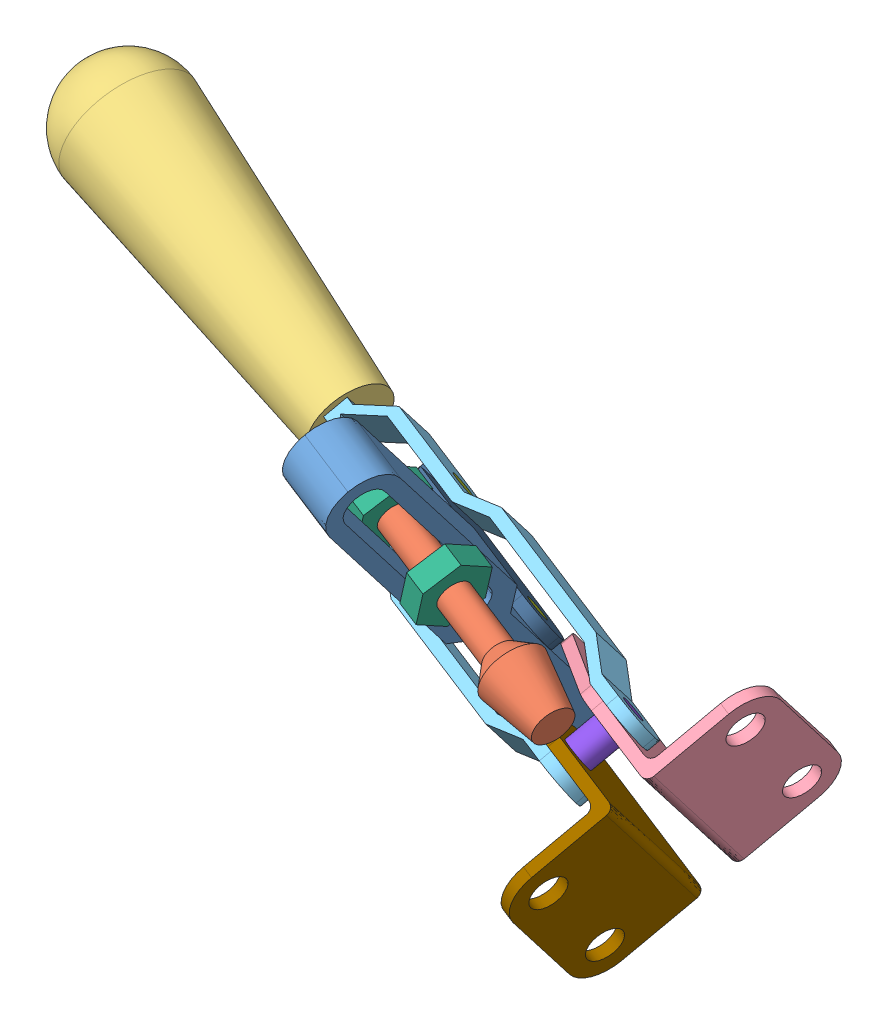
SolidWorks assembly Assem1.SLDASM, configuration Default (file format 9000). Lengths in mm.
Overall size (213.26 147.6 122.15).
13 component instances, 10 part files, 21 mates.
Components (placement in the parent):
- Arm-1: Arm.SLDPRT [Default] at (-75.0036 159.5998 247.2383) x (-0.105099 -0.774918 -0.623263) z (-0.938922 0.28384 -0.194578) size (138 18 16)
- Grip-1: Grip.SLDPRT [Default] at (-52.2328 179.7132 266.8056) x (-0.938922 0.28384 -0.194578) z (0.343962 0.791739 -0.504816) size (75 16 16)
- Handle-1: Handle.SLDPRT [Default] at (-163.5256 172.8819 213.5624) x (-0.938922 0.28384 -0.194578) z (-0.105099 -0.774918 -0.623263) size (98 32 32)
- Left Support-1: Left Support.SLDPRT [Default] at (-38.563 107.4842 209.6225) x (-0.105099 -0.774918 -0.623263) z (-0.938922 0.28384 -0.194578) size (48 30 57.58)
- Lever-1: Lever.SLDPRT [Default] at (-136.2767 171.0979 224.0212) x (-0.938922 0.28384 -0.194578) z (-0.327689 -0.564745 0.757418) size (176 16 28)
- Nut.SLDPRT-1: Nut.SLDPRT.SLDPRT [Default] at (-64.888 183.5389 264.183) x (0.330335 0.584895 -0.740795) z (-0.938922 0.28384 -0.194578) size (18.48 17.09 6)
- Pin A-1: Pin A.SLDPRT [Default] at (-81.3051 152.6729 224.8241) x (0.938899 -0.105303 0.327689) z (-0.327689 -0.564745 0.757418) size (6 6 14)
- Pin B-1: Pin B.SLDPRT [Default] at (-54.9539 139.1252 237.2248) x (0.327689 0.564745 -0.757418) z (0.757418 0.322175 0.567909) size (20 8 8)
- RightSupport-1: RightSupport.SLDPRT [Default] at (-41.1845 102.9662 215.6818) x (-0.105099 -0.774918 -0.623263) z (-0.938922 0.28384 -0.194578) size (48 30 57.58)
- Stop-1: Stop.SLDPRT [Default] at (-94.0261 145.5992 228.5693) x (0.938994 -0.283304 0.195009) z (-0.327689 -0.564745 0.757418) size (48 24 14)
- Nut.SLDPRT-3: Nut.SLDPRT.SLDPRT [Default] at (-91.1778 191.4865 258.7349) x (0.297219 0.95385 -0.042781) z (0.938922 -0.28384 0.194578) size (18.48 17.09 6)
- Pin A-3: Pin A.SLDPRT [Default] at (-110.3676 163.45 216.3254) x (0.938899 -0.105303 0.327689) z (-0.327689 -0.564745 0.757418) size (6 6 14)
- Pin A-4: Pin A.SLDPRT [Default] at (-84.6683 127.8755 204.8797) x (0.938899 -0.105303 0.327689) z (-0.327689 -0.564745 0.757418) size (6 6 14)
Mates (geometry in assembly coordinates):
- Parallel1: parallel anti-aligned: plane of Left Support-1 through (-39.5461 105.79 211.8948) normal (-0.327689 -0.564745 0.757418); plane of RightSupport-1 through (-42.1676 101.272 217.9541) normal (0.327689 0.564745 -0.757418)
- Coincident8: coincident anti-aligned: circle of Arm-1; circle of Left Support-1
- Coincident9: coincident aligned: circle of Arm-1; circle of RightSupport-1
- Coincident16: coincident anti-aligned: circle of Left Support-1; circle of Lever-1
- Coincident17: coincident aligned: circle of Lever-1; circle of RightSupport-1
- Coincident18: coincident anti-aligned: circle of Lever-1; circle of Stop-1
- Coincident19: coincident anti-aligned: circle of Arm-1; circle of Stop-1
- Coincident21: coincident anti-aligned: plane of Handle-1 through (-210.4074 195.4994 206.1827) normal (-0.327689 -0.564745 0.757418); plane of Lever-1 through (-212.089 183.1007 196.2105) normal (0.327689 0.564745 -0.757418)
- Coincident23: coincident anti-aligned: plane of Handle-1 through (-212.3735 192.1109 210.7273) normal (-0.105099 -0.774918 -0.623263); plane of Lever-1 through (-136.2767 171.0979 224.0212) normal (0.105099 0.774918 0.623263)
- Coincident24: coincident: line of Handle-1 through (-212.089 183.1007 196.2105) axis (0.105099 0.774918 0.623263); point of Lever-1
- Coincident27: coincident anti-aligned: plane of Arm-1 through (-90.0264 164.1413 244.125) normal (-0.938922 0.28384 -0.194578); plane of Nut.SLDPRT-3 through (-85.5443 189.7834 259.9023) normal (0.938922 -0.28384 0.194578)
- Coincident32: coincident anti-aligned: plane of Arm-1 through (-75.0036 159.5998 247.2383) normal (0.938922 -0.28384 0.194578); plane of Nut.SLDPRT-1 through (-70.5215 185.242 263.0156) normal (-0.938922 0.28384 -0.194578)
- Parallel4: parallel anti-aligned: line of Nut.SLDPRT-1 through (-73.0781 176.3239 262.343) axis (-0.041907 0.466902 0.883315); line of Nut.SLDPRT-3 through (-88.4907 185.2083 267.446) axis (0.041907 -0.466902 -0.883315)
- Lock1: lock: unknown of Grip-1; unknown of Nut.SLDPRT-3
- Lock2: lock: unknown of Grip-1; unknown of Nut.SLDPRT-1
- Coincident34: coincident anti-aligned: circle of Lever-1; circle of Pin B-1
- Coincident36: coincident aligned: circle of Pin A-1; circle of Stop-1
- Coincident38: coincident aligned: circle of Lever-1; circle of Pin A-3
- Coincident39: coincident aligned: circle of Left Support-1; circle of Pin A-4
- Slot1: slot aligned: cylinder of Grip-1 through (-30.5132 173.1473 271.3067) axis (0.938922 -0.28384 0.194578) radius 4; cylinder of Arm-1 through (-81.4638 219.8696 284.1005) axis (0.938922 -0.28384 0.194578) radius 5; cylinder of Arm-1 through (-87.3493 176.4742 249.1978) axis (0.938922 -0.28384 0.194578) radius 5
- LimitAngle6: limit planar angle = 1.570796 rad anti-aligned: plane of Left Support-1 through (-41.3798 108.3357 209.0388) normal (-0.938922 0.28384 -0.194578); plane of Lever-1 through (-137.9583 158.6992 214.049) normal (-0.105099 -0.774918 -0.623263)
